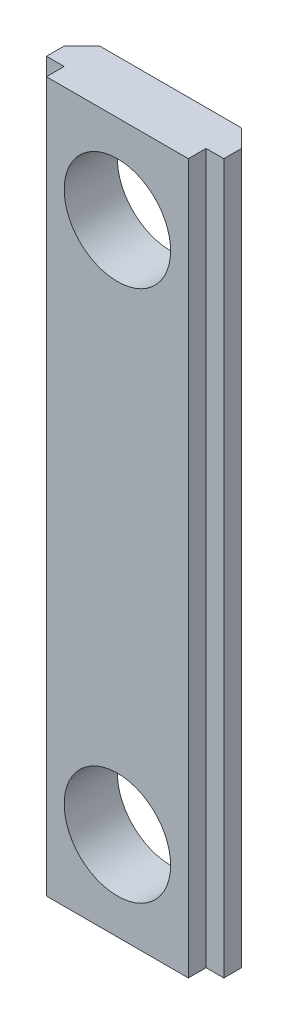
ISO-10303-21;
HEADER;
FILE_DESCRIPTION(('STEP AP214'),'2;1');
FILE_NAME('part.step','',(''),(''),'','','');
FILE_SCHEMA(('AUTOMOTIVE_DESIGN { 1 0 10303 214 1 1 1 1 }'));
ENDSEC;
DATA;
#1=APPLICATION_CONTEXT('core data for automotive mechanical design processes');
#2=APPLICATION_PROTOCOL_DEFINITION('international standard','automotive_design',2000,#1);
#3=PRODUCT_CONTEXT('',#1,'mechanical');
#4=PRODUCT('Part','Part','',(#3));
#5=PRODUCT_RELATED_PRODUCT_CATEGORY('part','',(#4));
#6=PRODUCT_DEFINITION_FORMATION('','',#4);
#7=PRODUCT_DEFINITION_CONTEXT('part definition',#1,'design');
#8=PRODUCT_DEFINITION('design','',#6,#7);
#9=PRODUCT_DEFINITION_SHAPE('','',#8);
#10=(LENGTH_UNIT() NAMED_UNIT(*) SI_UNIT(.MILLI.,.METRE.));
#11=(NAMED_UNIT(*) PLANE_ANGLE_UNIT() SI_UNIT($,.RADIAN.));
#12=(NAMED_UNIT(*) SI_UNIT($,.STERADIAN.) SOLID_ANGLE_UNIT());
#13=UNCERTAINTY_MEASURE_WITH_UNIT(LENGTH_MEASURE(1.E-05),#10,'distance_accuracy_value','');
#14=(GEOMETRIC_REPRESENTATION_CONTEXT(3) GLOBAL_UNCERTAINTY_ASSIGNED_CONTEXT((#13)) GLOBAL_UNIT_ASSIGNED_CONTEXT((#10,
#11,#12)) REPRESENTATION_CONTEXT('',''));
#15=CARTESIAN_POINT('',(0.,0.,0.));
#16=DIRECTION('',(0.,0.,1.));
#17=DIRECTION('',(1.,0.,0.));
#18=AXIS2_PLACEMENT_3D('',#15,#16,#17);
#19=CARTESIAN_POINT('',(-1.,40.,0.999697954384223));
#20=DIRECTION('',(0.706999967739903,0.,0.707213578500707));
#21=DIRECTION('',(0.707213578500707,0.,-0.706999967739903));
#22=AXIS2_PLACEMENT_3D('',#19,#20,#21);
#23=PLANE('',#22);
#24=DIRECTION('',(-0.707213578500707,0.,0.706999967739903));
#25=VECTOR('',#24,1.);
#26=CARTESIAN_POINT('',(-1.,0.,0.999697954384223));
#27=LINE('',#26,#25);
#28=CARTESIAN_POINT('',(0.,0.,0.));
#29=VERTEX_POINT('',#28);
#30=CARTESIAN_POINT('',(-1.,0.,0.999697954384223));
#31=VERTEX_POINT('',#30);
#32=EDGE_CURVE('E140',#29,#31,#27,.T.);
#33=ORIENTED_EDGE('',*,*,#32,.T.);
#34=DIRECTION('',(0.,-1.,0.));
#35=VECTOR('',#34,1.);
#36=CARTESIAN_POINT('',(-1.,40.,0.999697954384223));
#37=LINE('',#36,#35);
#38=CARTESIAN_POINT('',(-1.,40.,0.999697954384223));
#39=VERTEX_POINT('',#38);
#40=EDGE_CURVE('E11',#39,#31,#37,.T.);
#41=ORIENTED_EDGE('',*,*,#40,.F.);
#42=DIRECTION('',(-0.707213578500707,0.,0.706999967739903));
#43=VECTOR('',#42,1.);
#44=CARTESIAN_POINT('',(-1.,40.,0.999697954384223));
#45=LINE('',#44,#43);
#46=CARTESIAN_POINT('',(0.,40.,0.));
#47=VERTEX_POINT('',#46);
#48=EDGE_CURVE('E159',#47,#39,#45,.T.);
#49=ORIENTED_EDGE('',*,*,#48,.F.);
#50=DIRECTION('',(0.,-1.,0.));
#51=VECTOR('',#50,1.);
#52=CARTESIAN_POINT('',(0.,40.,0.));
#53=LINE('',#52,#51);
#54=EDGE_CURVE('E136',#47,#29,#53,.T.);
#55=ORIENTED_EDGE('',*,*,#54,.T.);
#56=EDGE_LOOP('',(#33,#41,#49,#55));
#57=FACE_BOUND('',#56,.T.);
#58=ADVANCED_FACE('F32',(#57),#23,.F.);
#59=CARTESIAN_POINT('',(-1.,40.,2.));
#60=DIRECTION('',(1.,0.,0.));
#61=DIRECTION('',(0.,0.,-1.));
#62=AXIS2_PLACEMENT_3D('',#59,#60,#61);
#63=PLANE('',#62);
#64=DIRECTION('',(0.,0.,1.));
#65=VECTOR('',#64,1.);
#66=CARTESIAN_POINT('',(-1.,0.,2.));
#67=LINE('',#66,#65);
#68=CARTESIAN_POINT('',(-1.,0.,2.));
#69=VERTEX_POINT('',#68);
#70=EDGE_CURVE('E143',#31,#69,#67,.T.);
#71=ORIENTED_EDGE('',*,*,#70,.T.);
#72=DIRECTION('',(0.,-1.,0.));
#73=VECTOR('',#72,1.);
#74=CARTESIAN_POINT('',(-1.,40.,2.));
#75=LINE('',#74,#73);
#76=CARTESIAN_POINT('',(-1.,40.,2.));
#77=VERTEX_POINT('',#76);
#78=EDGE_CURVE('E40',#77,#69,#75,.T.);
#79=ORIENTED_EDGE('',*,*,#78,.F.);
#80=DIRECTION('',(0.,0.,1.));
#81=VECTOR('',#80,1.);
#82=CARTESIAN_POINT('',(-1.,40.,2.));
#83=LINE('',#82,#81);
#84=EDGE_CURVE('E97',#39,#77,#83,.T.);
#85=ORIENTED_EDGE('',*,*,#84,.F.);
#86=ORIENTED_EDGE('',*,*,#40,.T.);
#87=EDGE_LOOP('',(#71,#79,#85,#86));
#88=FACE_BOUND('',#87,.T.);
#89=ADVANCED_FACE('F246',(#88),#63,.F.);
#90=CARTESIAN_POINT('',(0.,40.,2.));
#91=DIRECTION('',(0.,0.,-1.));
#92=DIRECTION('',(-1.,0.,0.));
#93=AXIS2_PLACEMENT_3D('',#90,#91,#92);
#94=PLANE('',#93);
#95=DIRECTION('',(1.,0.,0.));
#96=VECTOR('',#95,1.);
#97=CARTESIAN_POINT('',(0.,0.,2.));
#98=LINE('',#97,#96);
#99=CARTESIAN_POINT('',(0.,0.,2.));
#100=VERTEX_POINT('',#99);
#101=EDGE_CURVE('E146',#69,#100,#98,.T.);
#102=ORIENTED_EDGE('',*,*,#101,.T.);
#103=DIRECTION('',(0.,-1.,0.));
#104=VECTOR('',#103,1.);
#105=CARTESIAN_POINT('',(0.,40.,2.));
#106=LINE('',#105,#104);
#107=CARTESIAN_POINT('',(0.,40.,2.));
#108=VERTEX_POINT('',#107);
#109=EDGE_CURVE('E172',#108,#100,#106,.T.);
#110=ORIENTED_EDGE('',*,*,#109,.F.);
#111=DIRECTION('',(1.,0.,0.));
#112=VECTOR('',#111,1.);
#113=CARTESIAN_POINT('',(0.,40.,2.));
#114=LINE('',#113,#112);
#115=EDGE_CURVE('E180',#77,#108,#114,.T.);
#116=ORIENTED_EDGE('',*,*,#115,.F.);
#117=ORIENTED_EDGE('',*,*,#78,.T.);
#118=EDGE_LOOP('',(#102,#110,#116,#117));
#119=FACE_BOUND('',#118,.T.);
#120=ADVANCED_FACE('F178',(#119),#94,.F.);
#121=CARTESIAN_POINT('',(0.,40.,3.));
#122=DIRECTION('',(1.,0.,0.));
#123=DIRECTION('',(0.,0.,-1.));
#124=AXIS2_PLACEMENT_3D('',#121,#122,#123);
#125=PLANE('',#124);
#126=DIRECTION('',(0.,0.,1.));
#127=VECTOR('',#126,1.);
#128=CARTESIAN_POINT('',(0.,0.,3.));
#129=LINE('',#128,#127);
#130=CARTESIAN_POINT('',(0.,0.,3.));
#131=VERTEX_POINT('',#130);
#132=EDGE_CURVE('E148',#100,#131,#129,.T.);
#133=ORIENTED_EDGE('',*,*,#132,.T.);
#134=DIRECTION('',(0.,-1.,0.));
#135=VECTOR('',#134,1.);
#136=CARTESIAN_POINT('',(0.,40.,3.));
#137=LINE('',#136,#135);
#138=CARTESIAN_POINT('',(0.,40.,3.));
#139=VERTEX_POINT('',#138);
#140=EDGE_CURVE('E169',#139,#131,#137,.T.);
#141=ORIENTED_EDGE('',*,*,#140,.F.);
#142=DIRECTION('',(0.,0.,1.));
#143=VECTOR('',#142,1.);
#144=CARTESIAN_POINT('',(0.,40.,3.));
#145=LINE('',#144,#143);
#146=EDGE_CURVE('E198',#108,#139,#145,.T.);
#147=ORIENTED_EDGE('',*,*,#146,.F.);
#148=ORIENTED_EDGE('',*,*,#109,.T.);
#149=EDGE_LOOP('',(#133,#141,#147,#148));
#150=FACE_BOUND('',#149,.T.);
#151=ADVANCED_FACE('F189',(#150),#125,.F.);
#152=CARTESIAN_POINT('',(8.,40.,3.));
#153=DIRECTION('',(0.,0.,-1.));
#154=DIRECTION('',(-1.,0.,0.));
#155=AXIS2_PLACEMENT_3D('',#152,#153,#154);
#156=PLANE('',#155);
#157=CARTESIAN_POINT('',(4.,5.,3.));
#158=DIRECTION('',(0.,0.,1.));
#159=DIRECTION('',(1.,0.,0.));
#160=AXIS2_PLACEMENT_3D('',#157,#158,#159);
#161=CIRCLE('',#160,3.);
#162=CARTESIAN_POINT('',(7.,5.,3.));
#163=VERTEX_POINT('',#162);
#164=EDGE_CURVE('E214',#163,#163,#161,.T.);
#165=ORIENTED_EDGE('',*,*,#164,.F.);
#166=EDGE_LOOP('',(#165));
#167=FACE_BOUND('',#166,.T.);
#168=CARTESIAN_POINT('',(4.,35.,3.));
#169=DIRECTION('',(0.,0.,1.));
#170=DIRECTION('',(1.,0.,0.));
#171=AXIS2_PLACEMENT_3D('',#168,#169,#170);
#172=CIRCLE('',#171,3.);
#173=CARTESIAN_POINT('',(7.,35.,3.));
#174=VERTEX_POINT('',#173);
#175=EDGE_CURVE('E208',#174,#174,#172,.T.);
#176=ORIENTED_EDGE('',*,*,#175,.F.);
#177=EDGE_LOOP('',(#176));
#178=FACE_BOUND('',#177,.T.);
#179=DIRECTION('',(1.,0.,0.));
#180=VECTOR('',#179,1.);
#181=CARTESIAN_POINT('',(8.,0.,3.));
#182=LINE('',#181,#180);
#183=CARTESIAN_POINT('',(8.,0.,3.));
#184=VERTEX_POINT('',#183);
#185=EDGE_CURVE('E150',#131,#184,#182,.T.);
#186=ORIENTED_EDGE('',*,*,#185,.T.);
#187=DIRECTION('',(0.,-1.,0.));
#188=VECTOR('',#187,1.);
#189=CARTESIAN_POINT('',(8.,40.,3.));
#190=LINE('',#189,#188);
#191=CARTESIAN_POINT('',(8.,40.,3.));
#192=VERTEX_POINT('',#191);
#193=EDGE_CURVE('E166',#192,#184,#190,.T.);
#194=ORIENTED_EDGE('',*,*,#193,.F.);
#195=DIRECTION('',(1.,0.,0.));
#196=VECTOR('',#195,1.);
#197=CARTESIAN_POINT('',(8.,40.,3.));
#198=LINE('',#197,#196);
#199=EDGE_CURVE('E195',#139,#192,#198,.T.);
#200=ORIENTED_EDGE('',*,*,#199,.F.);
#201=ORIENTED_EDGE('',*,*,#140,.T.);
#202=EDGE_LOOP('',(#186,#194,#200,#201));
#203=FACE_BOUND('',#202,.T.);
#204=ADVANCED_FACE('F193',(#167,#178,#203),#156,.F.);
#205=CARTESIAN_POINT('',(8.,40.,2.00000000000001));
#206=DIRECTION('',(-1.,0.,0.));
#207=DIRECTION('',(0.,0.,1.));
#208=AXIS2_PLACEMENT_3D('',#205,#206,#207);
#209=PLANE('',#208);
#210=DIRECTION('',(0.,0.,-1.));
#211=VECTOR('',#210,1.);
#212=CARTESIAN_POINT('',(8.,0.,2.00000000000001));
#213=LINE('',#212,#211);
#214=CARTESIAN_POINT('',(8.,0.,2.00000000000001));
#215=VERTEX_POINT('',#214);
#216=EDGE_CURVE('E152',#184,#215,#213,.T.);
#217=ORIENTED_EDGE('',*,*,#216,.T.);
#218=DIRECTION('',(0.,-1.,0.));
#219=VECTOR('',#218,1.);
#220=CARTESIAN_POINT('',(8.,40.,2.00000000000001));
#221=LINE('',#220,#219);
#222=CARTESIAN_POINT('',(8.,40.,2.00000000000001));
#223=VERTEX_POINT('',#222);
#224=EDGE_CURVE('E163',#223,#215,#221,.T.);
#225=ORIENTED_EDGE('',*,*,#224,.F.);
#226=DIRECTION('',(0.,0.,-1.));
#227=VECTOR('',#226,1.);
#228=CARTESIAN_POINT('',(8.,40.,2.00000000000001));
#229=LINE('',#228,#227);
#230=EDGE_CURVE('E197',#192,#223,#229,.T.);
#231=ORIENTED_EDGE('',*,*,#230,.F.);
#232=ORIENTED_EDGE('',*,*,#193,.T.);
#233=EDGE_LOOP('',(#217,#225,#231,#232));
#234=FACE_BOUND('',#233,.T.);
#235=ADVANCED_FACE('F223',(#234),#209,.F.);
#236=CARTESIAN_POINT('',(9.,40.,2.00000000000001));
#237=DIRECTION('',(0.,0.,-1.));
#238=DIRECTION('',(-1.,0.,0.));
#239=AXIS2_PLACEMENT_3D('',#236,#237,#238);
#240=PLANE('',#239);
#241=DIRECTION('',(1.,0.,0.));
#242=VECTOR('',#241,1.);
#243=CARTESIAN_POINT('',(9.,0.,2.00000000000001));
#244=LINE('',#243,#242);
#245=CARTESIAN_POINT('',(9.,0.,2.00000000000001));
#246=VERTEX_POINT('',#245);
#247=EDGE_CURVE('E154',#215,#246,#244,.T.);
#248=ORIENTED_EDGE('',*,*,#247,.T.);
#249=DIRECTION('',(0.,-1.,0.));
#250=VECTOR('',#249,1.);
#251=CARTESIAN_POINT('',(9.,40.,2.00000000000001));
#252=LINE('',#251,#250);
#253=CARTESIAN_POINT('',(9.,40.,2.00000000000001));
#254=VERTEX_POINT('',#253);
#255=EDGE_CURVE('E131',#254,#246,#252,.T.);
#256=ORIENTED_EDGE('',*,*,#255,.F.);
#257=DIRECTION('',(1.,0.,0.));
#258=VECTOR('',#257,1.);
#259=CARTESIAN_POINT('',(9.,40.,2.00000000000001));
#260=LINE('',#259,#258);
#261=EDGE_CURVE('E122',#223,#254,#260,.T.);
#262=ORIENTED_EDGE('',*,*,#261,.F.);
#263=ORIENTED_EDGE('',*,*,#224,.T.);
#264=EDGE_LOOP('',(#248,#256,#262,#263));
#265=FACE_BOUND('',#264,.T.);
#266=ADVANCED_FACE('F255',(#265),#240,.F.);
#267=CARTESIAN_POINT('',(9.,40.,0.99969795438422));
#268=DIRECTION('',(-1.,0.,0.));
#269=DIRECTION('',(0.,0.,1.));
#270=AXIS2_PLACEMENT_3D('',#267,#268,#269);
#271=PLANE('',#270);
#272=DIRECTION('',(0.,0.,-1.));
#273=VECTOR('',#272,1.);
#274=CARTESIAN_POINT('',(9.,0.,0.99969795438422));
#275=LINE('',#274,#273);
#276=CARTESIAN_POINT('',(9.,0.,0.99969795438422));
#277=VERTEX_POINT('',#276);
#278=EDGE_CURVE('E130',#246,#277,#275,.T.);
#279=ORIENTED_EDGE('',*,*,#278,.T.);
#280=DIRECTION('',(0.,-1.,0.));
#281=VECTOR('',#280,1.);
#282=CARTESIAN_POINT('',(9.,40.,0.99969795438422));
#283=LINE('',#282,#281);
#284=CARTESIAN_POINT('',(9.,40.,0.99969795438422));
#285=VERTEX_POINT('',#284);
#286=EDGE_CURVE('E127',#285,#277,#283,.T.);
#287=ORIENTED_EDGE('',*,*,#286,.F.);
#288=DIRECTION('',(0.,0.,-1.));
#289=VECTOR('',#288,1.);
#290=CARTESIAN_POINT('',(9.,40.,0.99969795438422));
#291=LINE('',#290,#289);
#292=EDGE_CURVE('E116',#254,#285,#291,.T.);
#293=ORIENTED_EDGE('',*,*,#292,.F.);
#294=ORIENTED_EDGE('',*,*,#255,.T.);
#295=EDGE_LOOP('',(#279,#287,#293,#294));
#296=FACE_BOUND('',#295,.T.);
#297=ADVANCED_FACE('F128',(#296),#271,.F.);
#298=CARTESIAN_POINT('',(8.,40.,0.));
#299=DIRECTION('',(-0.706999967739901,0.,0.707213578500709));
#300=DIRECTION('',(0.707213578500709,0.,0.706999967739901));
#301=AXIS2_PLACEMENT_3D('',#298,#299,#300);
#302=PLANE('',#301);
#303=DIRECTION('',(-0.707213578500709,0.,-0.706999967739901));
#304=VECTOR('',#303,1.);
#305=CARTESIAN_POINT('',(8.,0.,0.));
#306=LINE('',#305,#304);
#307=CARTESIAN_POINT('',(8.,0.,0.));
#308=VERTEX_POINT('',#307);
#309=EDGE_CURVE('E83',#277,#308,#306,.T.);
#310=ORIENTED_EDGE('',*,*,#309,.T.);
#311=DIRECTION('',(0.,-1.,0.));
#312=VECTOR('',#311,1.);
#313=CARTESIAN_POINT('',(8.,40.,0.));
#314=LINE('',#313,#312);
#315=CARTESIAN_POINT('',(8.,40.,0.));
#316=VERTEX_POINT('',#315);
#317=EDGE_CURVE('E132',#316,#308,#314,.T.);
#318=ORIENTED_EDGE('',*,*,#317,.F.);
#319=DIRECTION('',(-0.707213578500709,0.,-0.706999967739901));
#320=VECTOR('',#319,1.);
#321=CARTESIAN_POINT('',(8.,40.,0.));
#322=LINE('',#321,#320);
#323=EDGE_CURVE('E120',#285,#316,#322,.T.);
#324=ORIENTED_EDGE('',*,*,#323,.F.);
#325=ORIENTED_EDGE('',*,*,#286,.T.);
#326=EDGE_LOOP('',(#310,#318,#324,#325));
#327=FACE_BOUND('',#326,.T.);
#328=ADVANCED_FACE('F134',(#327),#302,.F.);
#329=CARTESIAN_POINT('',(0.,40.,0.));
#330=DIRECTION('',(0.,0.,1.));
#331=DIRECTION('',(1.,0.,0.));
#332=AXIS2_PLACEMENT_3D('',#329,#330,#331);
#333=PLANE('',#332);
#334=CARTESIAN_POINT('',(4.,5.,0.));
#335=DIRECTION('',(0.,0.,1.));
#336=DIRECTION('',(1.,0.,0.));
#337=AXIS2_PLACEMENT_3D('',#334,#335,#336);
#338=CIRCLE('',#337,3.);
#339=CARTESIAN_POINT('',(7.,5.,0.));
#340=VERTEX_POINT('',#339);
#341=EDGE_CURVE('E211',#340,#340,#338,.F.);
#342=ORIENTED_EDGE('',*,*,#341,.F.);
#343=EDGE_LOOP('',(#342));
#344=FACE_BOUND('',#343,.T.);
#345=CARTESIAN_POINT('',(4.,35.,0.));
#346=DIRECTION('',(0.,0.,1.));
#347=DIRECTION('',(1.,0.,0.));
#348=AXIS2_PLACEMENT_3D('',#345,#346,#347);
#349=CIRCLE('',#348,3.);
#350=CARTESIAN_POINT('',(7.,35.,0.));
#351=VERTEX_POINT('',#350);
#352=EDGE_CURVE('E144',#351,#351,#349,.F.);
#353=ORIENTED_EDGE('',*,*,#352,.F.);
#354=EDGE_LOOP('',(#353));
#355=FACE_BOUND('',#354,.T.);
#356=DIRECTION('',(-1.,0.,0.));
#357=VECTOR('',#356,1.);
#358=CARTESIAN_POINT('',(0.,0.,0.));
#359=LINE('',#358,#357);
#360=EDGE_CURVE('E89',#308,#29,#359,.T.);
#361=ORIENTED_EDGE('',*,*,#360,.T.);
#362=ORIENTED_EDGE('',*,*,#54,.F.);
#363=DIRECTION('',(-1.,0.,0.));
#364=VECTOR('',#363,1.);
#365=CARTESIAN_POINT('',(0.,40.,0.));
#366=LINE('',#365,#364);
#367=EDGE_CURVE('E48',#316,#47,#366,.T.);
#368=ORIENTED_EDGE('',*,*,#367,.F.);
#369=ORIENTED_EDGE('',*,*,#317,.T.);
#370=EDGE_LOOP('',(#361,#362,#368,#369));
#371=FACE_BOUND('',#370,.T.);
#372=ADVANCED_FACE('F233',(#344,#355,#371),#333,.F.);
#373=CARTESIAN_POINT('',(3.99999999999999,40.,-3.99879181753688));
#374=DIRECTION('',(0.,-1.,0.));
#375=DIRECTION('',(0.,0.,-1.));
#376=AXIS2_PLACEMENT_3D('',#373,#374,#375);
#377=PLANE('',#376);
#378=ORIENTED_EDGE('',*,*,#48,.T.);
#379=ORIENTED_EDGE('',*,*,#84,.T.);
#380=ORIENTED_EDGE('',*,*,#115,.T.);
#381=ORIENTED_EDGE('',*,*,#146,.T.);
#382=ORIENTED_EDGE('',*,*,#199,.T.);
#383=ORIENTED_EDGE('',*,*,#230,.T.);
#384=ORIENTED_EDGE('',*,*,#261,.T.);
#385=ORIENTED_EDGE('',*,*,#292,.T.);
#386=ORIENTED_EDGE('',*,*,#323,.T.);
#387=ORIENTED_EDGE('',*,*,#367,.T.);
#388=EDGE_LOOP('',(#378,#379,#380,#381,#382,#383,#384,#385,#386,#387));
#389=FACE_BOUND('',#388,.T.);
#390=ADVANCED_FACE('F118',(#389),#377,.F.);
#391=CARTESIAN_POINT('',(3.99999999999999,0.,-3.99879181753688));
#392=DIRECTION('',(0.,-1.,0.));
#393=DIRECTION('',(0.,0.,-1.));
#394=AXIS2_PLACEMENT_3D('',#391,#392,#393);
#395=PLANE('',#394);
#396=ORIENTED_EDGE('',*,*,#32,.F.);
#397=ORIENTED_EDGE('',*,*,#360,.F.);
#398=ORIENTED_EDGE('',*,*,#309,.F.);
#399=ORIENTED_EDGE('',*,*,#278,.F.);
#400=ORIENTED_EDGE('',*,*,#247,.F.);
#401=ORIENTED_EDGE('',*,*,#216,.F.);
#402=ORIENTED_EDGE('',*,*,#185,.F.);
#403=ORIENTED_EDGE('',*,*,#132,.F.);
#404=ORIENTED_EDGE('',*,*,#101,.F.);
#405=ORIENTED_EDGE('',*,*,#70,.F.);
#406=EDGE_LOOP('',(#396,#397,#398,#399,#400,#401,#402,#403,#404,#405));
#407=FACE_BOUND('',#406,.T.);
#408=ADVANCED_FACE('F184',(#407),#395,.T.);
#409=CARTESIAN_POINT('',(4.,35.,-0.00100000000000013));
#410=DIRECTION('',(0.,0.,1.));
#411=DIRECTION('',(1.,0.,0.));
#412=AXIS2_PLACEMENT_3D('',#409,#410,#411);
#413=CYLINDRICAL_SURFACE('',#412,3.);
#414=CARTESIAN_POINT('',(7.,35.,3.));
#415=CARTESIAN_POINT('',(7.,35.,2.96875));
#416=CARTESIAN_POINT('',(7.,35.,2.9375));
#417=CARTESIAN_POINT('',(7.,35.,2.875));
#418=CARTESIAN_POINT('',(7.,35.,2.84375));
#419=CARTESIAN_POINT('',(7.,35.,2.78125));
#420=CARTESIAN_POINT('',(7.,35.,2.75));
#421=CARTESIAN_POINT('',(7.,35.,2.6875));
#422=CARTESIAN_POINT('',(7.,35.,2.65625));
#423=CARTESIAN_POINT('',(7.,35.,2.59375));
#424=CARTESIAN_POINT('',(7.,35.,2.5625));
#425=CARTESIAN_POINT('',(7.,35.,2.5));
#426=CARTESIAN_POINT('',(7.,35.,2.46875));
#427=CARTESIAN_POINT('',(7.,35.,2.40625));
#428=CARTESIAN_POINT('',(7.,35.,2.375));
#429=CARTESIAN_POINT('',(7.,35.,2.3125));
#430=CARTESIAN_POINT('',(7.,35.,2.28125));
#431=CARTESIAN_POINT('',(7.,35.,2.21875));
#432=CARTESIAN_POINT('',(7.,35.,2.1875));
#433=CARTESIAN_POINT('',(7.,35.,2.125));
#434=CARTESIAN_POINT('',(7.,35.,2.09375));
#435=CARTESIAN_POINT('',(7.,35.,2.03125));
#436=CARTESIAN_POINT('',(7.,35.,2.));
#437=CARTESIAN_POINT('',(7.,35.,1.9375));
#438=CARTESIAN_POINT('',(7.,35.,1.90625));
#439=CARTESIAN_POINT('',(7.,35.,1.84375));
#440=CARTESIAN_POINT('',(7.,35.,1.8125));
#441=CARTESIAN_POINT('',(7.,35.,1.75));
#442=CARTESIAN_POINT('',(7.,35.,1.71875));
#443=CARTESIAN_POINT('',(7.,35.,1.65625));
#444=CARTESIAN_POINT('',(7.,35.,1.625));
#445=CARTESIAN_POINT('',(7.,35.,1.5625));
#446=CARTESIAN_POINT('',(7.,35.,1.53125));
#447=CARTESIAN_POINT('',(7.,35.,1.46875));
#448=CARTESIAN_POINT('',(7.,35.,1.4375));
#449=CARTESIAN_POINT('',(7.,35.,1.375));
#450=CARTESIAN_POINT('',(7.,35.,1.34375));
#451=CARTESIAN_POINT('',(7.,35.,1.28125));
#452=CARTESIAN_POINT('',(7.,35.,1.25));
#453=CARTESIAN_POINT('',(7.,35.,1.1875));
#454=CARTESIAN_POINT('',(7.,35.,1.15625));
#455=CARTESIAN_POINT('',(7.,35.,1.09375));
#456=CARTESIAN_POINT('',(7.,35.,1.0625));
#457=CARTESIAN_POINT('',(7.,35.,1.));
#458=CARTESIAN_POINT('',(7.,35.,0.968750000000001));
#459=CARTESIAN_POINT('',(7.,35.,0.906250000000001));
#460=CARTESIAN_POINT('',(7.,35.,0.875000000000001));
#461=CARTESIAN_POINT('',(7.,35.,0.812500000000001));
#462=CARTESIAN_POINT('',(7.,35.,0.781250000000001));
#463=CARTESIAN_POINT('',(7.,35.,0.718750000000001));
#464=CARTESIAN_POINT('',(7.,35.,0.687500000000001));
#465=CARTESIAN_POINT('',(7.,35.,0.625));
#466=CARTESIAN_POINT('',(7.,35.,0.59375));
#467=CARTESIAN_POINT('',(7.,35.,0.53125));
#468=CARTESIAN_POINT('',(7.,35.,0.5));
#469=CARTESIAN_POINT('',(7.,35.,0.4375));
#470=CARTESIAN_POINT('',(7.,35.,0.40625));
#471=CARTESIAN_POINT('',(7.,35.,0.34375));
#472=CARTESIAN_POINT('',(7.,35.,0.3125));
#473=CARTESIAN_POINT('',(7.,35.,0.25));
#474=CARTESIAN_POINT('',(7.,35.,0.21875));
#475=CARTESIAN_POINT('',(7.,35.,0.15625));
#476=CARTESIAN_POINT('',(7.,35.,0.125));
#477=CARTESIAN_POINT('',(7.,35.,0.0625000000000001));
#478=CARTESIAN_POINT('',(7.,35.,0.03125));
#479=CARTESIAN_POINT('',(7.,35.,0.));
#480=B_SPLINE_CURVE_WITH_KNOTS('',3,(#414,#415,#416,#417,#418,#419,#420,#421,#422,#423,#424,
#425,#426,#427,#428,#429,#430,#431,#432,#433,#434,#435,#436,#437,#438,#439,#440,#441,#442,#443,
#444,#445,#446,#447,#448,#449,#450,#451,#452,#453,#454,#455,#456,#457,#458,#459,#460,#461,#462,
#463,#464,#465,#466,#467,#468,#469,#470,#471,#472,#473,#474,#475,#476,#477,#478,#479),
.UNSPECIFIED.,.F.,.F.,(4,2,2,2,2,2,2,2,2,2,2,2,2,2,2,2,2,2,2,2,2,2,2,2,2,2,2,2,2,2,2,2,4),(0.,
0.0937500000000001,0.1875,0.28125,0.375,0.46875,0.5625,0.656250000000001,0.750000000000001,
0.843750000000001,0.937500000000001,1.03125,1.125,1.21875,1.3125,1.40625,1.5,1.59375,1.6875,
1.78125,1.875,1.96875,2.0625,2.15625,2.25,2.34375,2.4375,2.53125,2.625,2.71875,2.8125,2.90625,
3.),.UNSPECIFIED.);
#481=EDGE_CURVE('BSEAM227',#174,#351,#480,.T.);
#482=ORIENTED_EDGE('',*,*,#175,.T.);
#483=ORIENTED_EDGE('',*,*,#352,.T.);
#484=ORIENTED_EDGE('',*,*,#481,.T.);
#485=ORIENTED_EDGE('',*,*,#481,.F.);
#486=EDGE_LOOP('',(#482,#484,#483,#485));
#487=FACE_BOUND('',#486,.T.);
#488=ADVANCED_FACE('F227',(#487),#413,.F.);
#489=CARTESIAN_POINT('',(4.,5.,-0.00100000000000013));
#490=DIRECTION('',(0.,0.,1.));
#491=DIRECTION('',(1.,0.,0.));
#492=AXIS2_PLACEMENT_3D('',#489,#490,#491);
#493=CYLINDRICAL_SURFACE('',#492,3.);
#494=CARTESIAN_POINT('',(7.,5.,3.));
#495=CARTESIAN_POINT('',(7.,5.,2.96875));
#496=CARTESIAN_POINT('',(7.,5.,2.9375));
#497=CARTESIAN_POINT('',(7.,5.,2.875));
#498=CARTESIAN_POINT('',(7.,5.,2.84375));
#499=CARTESIAN_POINT('',(7.,5.,2.78125));
#500=CARTESIAN_POINT('',(7.,5.,2.75));
#501=CARTESIAN_POINT('',(7.,5.,2.6875));
#502=CARTESIAN_POINT('',(7.,5.,2.65625));
#503=CARTESIAN_POINT('',(7.,5.,2.59375));
#504=CARTESIAN_POINT('',(7.,5.,2.5625));
#505=CARTESIAN_POINT('',(7.,5.,2.5));
#506=CARTESIAN_POINT('',(7.,5.,2.46875));
#507=CARTESIAN_POINT('',(7.,5.,2.40625));
#508=CARTESIAN_POINT('',(7.,5.,2.375));
#509=CARTESIAN_POINT('',(7.,5.,2.3125));
#510=CARTESIAN_POINT('',(7.,5.,2.28125));
#511=CARTESIAN_POINT('',(7.,5.,2.21875));
#512=CARTESIAN_POINT('',(7.,5.,2.1875));
#513=CARTESIAN_POINT('',(7.,5.,2.125));
#514=CARTESIAN_POINT('',(7.,5.,2.09375));
#515=CARTESIAN_POINT('',(7.,5.,2.03125));
#516=CARTESIAN_POINT('',(7.,5.,2.));
#517=CARTESIAN_POINT('',(7.,5.,1.9375));
#518=CARTESIAN_POINT('',(7.,5.,1.90625));
#519=CARTESIAN_POINT('',(7.,5.,1.84375));
#520=CARTESIAN_POINT('',(7.,5.,1.8125));
#521=CARTESIAN_POINT('',(7.,5.,1.75));
#522=CARTESIAN_POINT('',(7.,5.,1.71875));
#523=CARTESIAN_POINT('',(7.,5.,1.65625));
#524=CARTESIAN_POINT('',(7.,5.,1.625));
#525=CARTESIAN_POINT('',(7.,5.,1.5625));
#526=CARTESIAN_POINT('',(7.,5.,1.53125));
#527=CARTESIAN_POINT('',(7.,5.,1.46875));
#528=CARTESIAN_POINT('',(7.,5.,1.4375));
#529=CARTESIAN_POINT('',(7.,5.,1.375));
#530=CARTESIAN_POINT('',(7.,5.,1.34375));
#531=CARTESIAN_POINT('',(7.,5.,1.28125));
#532=CARTESIAN_POINT('',(7.,5.,1.25));
#533=CARTESIAN_POINT('',(7.,5.,1.1875));
#534=CARTESIAN_POINT('',(7.,5.,1.15625));
#535=CARTESIAN_POINT('',(7.,5.,1.09375));
#536=CARTESIAN_POINT('',(7.,5.,1.0625));
#537=CARTESIAN_POINT('',(7.,5.,1.));
#538=CARTESIAN_POINT('',(7.,5.,0.968750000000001));
#539=CARTESIAN_POINT('',(7.,5.,0.906250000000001));
#540=CARTESIAN_POINT('',(7.,5.,0.875000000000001));
#541=CARTESIAN_POINT('',(7.,5.,0.812500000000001));
#542=CARTESIAN_POINT('',(7.,5.,0.781250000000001));
#543=CARTESIAN_POINT('',(7.,5.,0.718750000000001));
#544=CARTESIAN_POINT('',(7.,5.,0.687500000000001));
#545=CARTESIAN_POINT('',(7.,5.,0.625));
#546=CARTESIAN_POINT('',(7.,5.,0.59375));
#547=CARTESIAN_POINT('',(7.,5.,0.53125));
#548=CARTESIAN_POINT('',(7.,5.,0.5));
#549=CARTESIAN_POINT('',(7.,5.,0.4375));
#550=CARTESIAN_POINT('',(7.,5.,0.40625));
#551=CARTESIAN_POINT('',(7.,5.,0.34375));
#552=CARTESIAN_POINT('',(7.,5.,0.3125));
#553=CARTESIAN_POINT('',(7.,5.,0.25));
#554=CARTESIAN_POINT('',(7.,5.,0.21875));
#555=CARTESIAN_POINT('',(7.,5.,0.15625));
#556=CARTESIAN_POINT('',(7.,5.,0.125));
#557=CARTESIAN_POINT('',(7.,5.,0.0625000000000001));
#558=CARTESIAN_POINT('',(7.,5.,0.03125));
#559=CARTESIAN_POINT('',(7.,5.,0.));
#560=B_SPLINE_CURVE_WITH_KNOTS('',3,(#494,#495,#496,#497,#498,#499,#500,#501,#502,#503,#504,
#505,#506,#507,#508,#509,#510,#511,#512,#513,#514,#515,#516,#517,#518,#519,#520,#521,#522,#523,
#524,#525,#526,#527,#528,#529,#530,#531,#532,#533,#534,#535,#536,#537,#538,#539,#540,#541,#542,
#543,#544,#545,#546,#547,#548,#549,#550,#551,#552,#553,#554,#555,#556,#557,#558,#559),
.UNSPECIFIED.,.F.,.F.,(4,2,2,2,2,2,2,2,2,2,2,2,2,2,2,2,2,2,2,2,2,2,2,2,2,2,2,2,2,2,2,2,4),(0.,
0.0937500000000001,0.1875,0.28125,0.375,0.46875,0.5625,0.656250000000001,0.750000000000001,
0.843750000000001,0.937500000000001,1.03125,1.125,1.21875,1.3125,1.40625,1.5,1.59375,1.6875,
1.78125,1.875,1.96875,2.0625,2.15625,2.25,2.34375,2.4375,2.53125,2.625,2.71875,2.8125,2.90625,
3.),.UNSPECIFIED.);
#561=EDGE_CURVE('BSEAM218',#163,#340,#560,.T.);
#562=ORIENTED_EDGE('',*,*,#164,.T.);
#563=ORIENTED_EDGE('',*,*,#341,.T.);
#564=ORIENTED_EDGE('',*,*,#561,.T.);
#565=ORIENTED_EDGE('',*,*,#561,.F.);
#566=EDGE_LOOP('',(#562,#564,#563,#565));
#567=FACE_BOUND('',#566,.T.);
#568=ADVANCED_FACE('F218',(#567),#493,.F.);
#569=CLOSED_SHELL('',(#58,#89,#120,#151,#204,#235,#266,#297,#328,#372,#390,#408,#488,#568));
#570=MANIFOLD_SOLID_BREP('B2',#569);
#571=ADVANCED_BREP_SHAPE_REPRESENTATION('',(#18,#570),#14);
#572=SHAPE_DEFINITION_REPRESENTATION(#9,#571);
ENDSEC;
END-ISO-10303-21;
